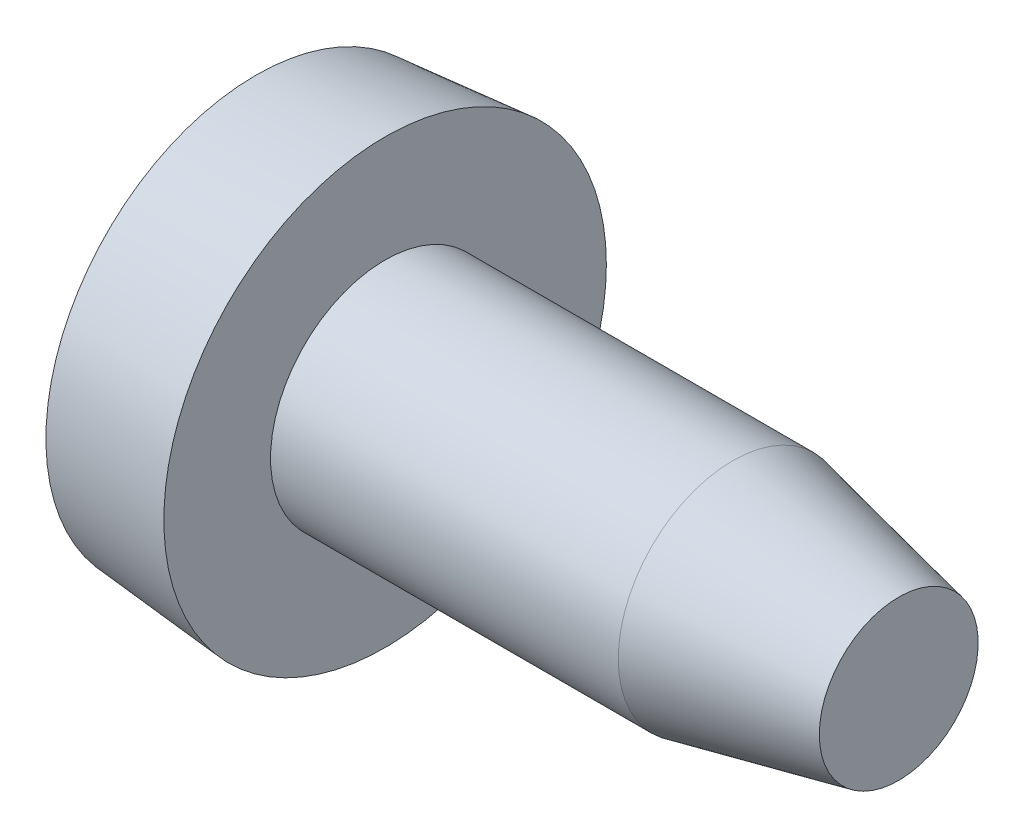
ISO-10303-21;
HEADER;
FILE_DESCRIPTION(('STEP AP214'),'2;1');
FILE_NAME('part.step','',(''),(''),'','','');
FILE_SCHEMA(('AUTOMOTIVE_DESIGN { 1 0 10303 214 1 1 1 1 }'));
ENDSEC;
DATA;
#1=APPLICATION_CONTEXT('core data for automotive mechanical design processes');
#2=APPLICATION_PROTOCOL_DEFINITION('international standard','automotive_design',2000,#1);
#3=PRODUCT_CONTEXT('',#1,'mechanical');
#4=PRODUCT('Part','Part','',(#3));
#5=PRODUCT_RELATED_PRODUCT_CATEGORY('part','',(#4));
#6=PRODUCT_DEFINITION_FORMATION('','',#4);
#7=PRODUCT_DEFINITION_CONTEXT('part definition',#1,'design');
#8=PRODUCT_DEFINITION('design','',#6,#7);
#9=PRODUCT_DEFINITION_SHAPE('','',#8);
#10=(LENGTH_UNIT() NAMED_UNIT(*) SI_UNIT(.MILLI.,.METRE.));
#11=(NAMED_UNIT(*) PLANE_ANGLE_UNIT() SI_UNIT($,.RADIAN.));
#12=(NAMED_UNIT(*) SI_UNIT($,.STERADIAN.) SOLID_ANGLE_UNIT());
#13=UNCERTAINTY_MEASURE_WITH_UNIT(LENGTH_MEASURE(1.E-05),#10,'distance_accuracy_value','');
#14=(GEOMETRIC_REPRESENTATION_CONTEXT(3) GLOBAL_UNCERTAINTY_ASSIGNED_CONTEXT((#13)) GLOBAL_UNIT_ASSIGNED_CONTEXT((#10,
#11,#12)) REPRESENTATION_CONTEXT('',''));
#15=CARTESIAN_POINT('',(0.,0.,0.));
#16=DIRECTION('',(0.,0.,1.));
#17=DIRECTION('',(1.,0.,0.));
#18=AXIS2_PLACEMENT_3D('',#15,#16,#17);
#19=CARTESIAN_POINT('',(-1.70366554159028,0.,-0.255));
#20=DIRECTION('',(0.,0.,1.));
#21=DIRECTION('',(1.,0.,0.));
#22=AXIS2_PLACEMENT_3D('',#19,#20,#21);
#23=PLANE('',#22);
#24=CARTESIAN_POINT('',(-2.38697804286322,-0.254999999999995,-0.255));
#25=CARTESIAN_POINT('',(-2.38080941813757,-0.375863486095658,-0.255000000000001));
#26=CARTESIAN_POINT('',(-2.37022720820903,-0.496488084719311,-0.255));
#27=CARTESIAN_POINT('',(-2.34040446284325,-0.736102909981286,-0.255));
#28=CARTESIAN_POINT('',(-2.321203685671,-0.855098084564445,-0.254999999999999));
#29=CARTESIAN_POINT('',(-2.26269549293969,-1.14959225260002,-0.255));
#30=CARTESIAN_POINT('',(-2.21814295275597,-1.32406276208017,-0.255000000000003));
#31=CARTESIAN_POINT('',(-2.16423628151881,-1.4956696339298,-0.25500000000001));
#32=B_SPLINE_CURVE_WITH_KNOTS('',3,(#24,#25,#26,#27,#28,#29,#30,#31),.UNSPECIFIED.,.F.,.F.,(4,2,
2,4),(0.,0.362956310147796,0.724255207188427,1.26345566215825),.UNSPECIFIED.);
#33=CARTESIAN_POINT('',(-2.38697804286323,-0.254999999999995,-0.255));
#34=VERTEX_POINT('',#33);
#35=CARTESIAN_POINT('',(-2.16423628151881,-1.49566963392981,-0.255000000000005));
#36=VERTEX_POINT('',#35);
#37=EDGE_CURVE('E19',#34,#36,#32,.T.);
#38=ORIENTED_EDGE('',*,*,#37,.T.);
#39=DIRECTION('',(0.78348098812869,0.621415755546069,0.));
#40=VECTOR('',#39,1.);
#41=CARTESIAN_POINT('',(-0.599999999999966,-0.254999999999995,-0.255));
#42=LINE('',#41,#40);
#43=CARTESIAN_POINT('',(-0.599999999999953,-0.254999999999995,-0.254999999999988));
#44=VERTEX_POINT('',#43);
#45=EDGE_CURVE('E79',#36,#44,#42,.T.);
#46=ORIENTED_EDGE('',*,*,#45,.T.);
#47=DIRECTION('',(1.,0.,0.));
#48=VECTOR('',#47,1.);
#49=CARTESIAN_POINT('',(-1.70366554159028,-0.254999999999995,-0.255));
#50=LINE('',#49,#48);
#51=EDGE_CURVE('E221',#44,#34,#50,.F.);
#52=ORIENTED_EDGE('',*,*,#51,.T.);
#53=EDGE_LOOP('',(#38,#46,#52));
#54=FACE_BOUND('',#53,.T.);
#55=ADVANCED_FACE('F15',(#54),#23,.T.);
#56=CARTESIAN_POINT('',(-1.70366554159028,-0.254999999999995,0.));
#57=DIRECTION('',(0.,-1.,0.));
#58=DIRECTION('',(0.,0.,-1.));
#59=AXIS2_PLACEMENT_3D('',#56,#57,#58);
#60=PLANE('',#59);
#61=ORIENTED_EDGE('',*,*,#51,.F.);
#62=DIRECTION('',(-0.78348098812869,0.,-0.621415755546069));
#63=VECTOR('',#62,1.);
#64=CARTESIAN_POINT('',(-0.599999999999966,-0.254999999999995,-0.254999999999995));
#65=LINE('',#64,#63);
#66=CARTESIAN_POINT('',(-2.16423628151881,-0.255,-1.49566963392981));
#67=VERTEX_POINT('',#66);
#68=EDGE_CURVE('E291',#44,#67,#65,.T.);
#69=ORIENTED_EDGE('',*,*,#68,.T.);
#70=CARTESIAN_POINT('',(-2.38697804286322,-0.254999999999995,-0.255));
#71=CARTESIAN_POINT('',(-2.38080941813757,-0.254999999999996,-0.375863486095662));
#72=CARTESIAN_POINT('',(-2.37022720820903,-0.254999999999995,-0.496488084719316));
#73=CARTESIAN_POINT('',(-2.34040446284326,-0.254999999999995,-0.736102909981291));
#74=CARTESIAN_POINT('',(-2.321203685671,-0.254999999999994,-0.85509808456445));
#75=CARTESIAN_POINT('',(-2.2626954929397,-0.254999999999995,-1.14959225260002));
#76=CARTESIAN_POINT('',(-2.21814295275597,-0.254999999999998,-1.32406276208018));
#77=CARTESIAN_POINT('',(-2.16423628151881,-0.255000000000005,-1.4956696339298));
#78=B_SPLINE_CURVE_WITH_KNOTS('',3,(#70,#71,#72,#73,#74,#75,#76,#77),.UNSPECIFIED.,.F.,.F.,(4,2,
2,4),(0.,0.362956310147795,0.724255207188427,1.26345566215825),.UNSPECIFIED.);
#79=EDGE_CURVE('E216',#34,#67,#78,.T.);
#80=ORIENTED_EDGE('',*,*,#79,.F.);
#81=EDGE_LOOP('',(#61,#69,#80));
#82=FACE_BOUND('',#81,.T.);
#83=ADVANCED_FACE('F222',(#82),#60,.F.);
#84=CARTESIAN_POINT('',(-0.599999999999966,-0.254999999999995,0.));
#85=DIRECTION('',(0.621415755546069,-0.78348098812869,0.));
#86=DIRECTION('',(0.78348098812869,0.621415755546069,0.));
#87=AXIS2_PLACEMENT_3D('',#84,#85,#86);
#88=PLANE('',#87);
#89=DIRECTION('',(0.783480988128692,0.621415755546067,0.));
#90=VECTOR('',#89,1.);
#91=CARTESIAN_POINT('',(-2.16423628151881,-1.49566963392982,0.255));
#92=LINE('',#91,#90);
#93=CARTESIAN_POINT('',(-2.16423628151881,-1.49566963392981,0.255000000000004));
#94=VERTEX_POINT('',#93);
#95=CARTESIAN_POINT('',(-0.599999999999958,-0.254999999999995,0.25500000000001));
#96=VERTEX_POINT('',#95);
#97=EDGE_CURVE('E330',#94,#96,#92,.T.);
#98=ORIENTED_EDGE('',*,*,#97,.T.);
#99=DIRECTION('',(0.,0.,1.));
#100=VECTOR('',#99,1.);
#101=CARTESIAN_POINT('',(-0.599999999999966,-0.254999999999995,0.));
#102=LINE('',#101,#100);
#103=EDGE_CURVE('E98',#44,#96,#102,.T.);
#104=ORIENTED_EDGE('',*,*,#103,.F.);
#105=ORIENTED_EDGE('',*,*,#45,.F.);
#106=CARTESIAN_POINT('',(-2.1642362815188,-1.49566963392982,0.255));
#107=CARTESIAN_POINT('',(-2.16787609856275,-1.49855654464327,0.17));
#108=CARTESIAN_POINT('',(-2.16969600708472,-1.5,0.0850000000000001));
#109=CARTESIAN_POINT('',(-2.16969600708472,-1.5,-0.0849999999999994));
#110=CARTESIAN_POINT('',(-2.16787609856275,-1.49855654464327,-0.169999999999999));
#111=CARTESIAN_POINT('',(-2.1642362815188,-1.49566963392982,-0.254999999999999));
#112=B_SPLINE_CURVE_WITH_KNOTS('',3,(#106,#107,#108,#109,#110,#111),.UNSPECIFIED.,.F.,.F.,(4,2,
4),(0.,0.255095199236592,0.510190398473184),.UNSPECIFIED.);
#113=EDGE_CURVE('E211',#94,#36,#112,.T.);
#114=ORIENTED_EDGE('',*,*,#113,.F.);
#115=EDGE_LOOP('',(#98,#104,#105,#114));
#116=FACE_BOUND('',#115,.T.);
#117=ADVANCED_FACE('F225',(#116),#88,.F.);
#118=CARTESIAN_POINT('',(-0.599999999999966,0.,-0.254999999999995));
#119=DIRECTION('',(0.621415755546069,0.,-0.78348098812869));
#120=DIRECTION('',(-0.78348098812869,0.,-0.621415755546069));
#121=AXIS2_PLACEMENT_3D('',#118,#119,#120);
#122=PLANE('',#121);
#123=ORIENTED_EDGE('',*,*,#68,.F.);
#124=DIRECTION('',(0.,1.,0.));
#125=VECTOR('',#124,1.);
#126=CARTESIAN_POINT('',(-0.599999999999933,0.,-0.254999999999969));
#127=LINE('',#126,#125);
#128=CARTESIAN_POINT('',(-0.599999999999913,0.254999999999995,-0.254999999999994));
#129=VERTEX_POINT('',#128);
#130=EDGE_CURVE('E289',#129,#44,#127,.F.);
#131=ORIENTED_EDGE('',*,*,#130,.F.);
#132=DIRECTION('',(0.783480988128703,0.,0.621415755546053));
#133=VECTOR('',#132,1.);
#134=CARTESIAN_POINT('',(-2.16423628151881,0.254999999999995,-1.49566963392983));
#135=LINE('',#134,#133);
#136=CARTESIAN_POINT('',(-2.16423628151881,0.254999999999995,-1.49566963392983));
#137=VERTEX_POINT('',#136);
#138=EDGE_CURVE('E323',#137,#129,#135,.T.);
#139=ORIENTED_EDGE('',*,*,#138,.F.);
#140=CARTESIAN_POINT('',(-2.16423628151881,-0.254999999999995,-1.49566963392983));
#141=CARTESIAN_POINT('',(-2.16787609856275,-0.169999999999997,-1.49855654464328));
#142=CARTESIAN_POINT('',(-2.16969600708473,-0.084999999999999,-1.5));
#143=CARTESIAN_POINT('',(-2.16969600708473,0.084999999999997,-1.5));
#144=CARTESIAN_POINT('',(-2.16787609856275,0.169999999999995,-1.49855654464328));
#145=CARTESIAN_POINT('',(-2.16423628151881,0.254999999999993,-1.49566963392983));
#146=B_SPLINE_CURVE_WITH_KNOTS('',3,(#140,#141,#142,#143,#144,#145),.UNSPECIFIED.,.F.,.F.,(4,2,
4),(0.,0.255095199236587,0.510190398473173),.UNSPECIFIED.);
#147=EDGE_CURVE('E205',#67,#137,#146,.T.);
#148=ORIENTED_EDGE('',*,*,#147,.F.);
#149=EDGE_LOOP('',(#123,#131,#139,#148));
#150=FACE_BOUND('',#149,.T.);
#151=ADVANCED_FACE('F230',(#150),#122,.F.);
#152=CARTESIAN_POINT('',(-1.70366554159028,0.,0.255));
#153=DIRECTION('',(0.,0.,1.));
#154=DIRECTION('',(1.,0.,0.));
#155=AXIS2_PLACEMENT_3D('',#152,#153,#154);
#156=PLANE('',#155);
#157=ORIENTED_EDGE('',*,*,#97,.F.);
#158=CARTESIAN_POINT('',(-2.38697804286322,-0.254999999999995,0.255));
#159=CARTESIAN_POINT('',(-2.38080941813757,-0.375863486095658,0.255));
#160=CARTESIAN_POINT('',(-2.37022720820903,-0.496488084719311,0.255));
#161=CARTESIAN_POINT('',(-2.34040446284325,-0.736102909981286,0.255));
#162=CARTESIAN_POINT('',(-2.321203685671,-0.855098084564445,0.255));
#163=CARTESIAN_POINT('',(-2.26269549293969,-1.14959225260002,0.255000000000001));
#164=CARTESIAN_POINT('',(-2.21814295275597,-1.32406276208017,0.255000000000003));
#165=CARTESIAN_POINT('',(-2.16423628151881,-1.4956696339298,0.255000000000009));
#166=B_SPLINE_CURVE_WITH_KNOTS('',3,(#158,#159,#160,#161,#162,#163,#164,#165),.UNSPECIFIED.,.F.,
.F.,(4,2,2,4),(0.,0.362956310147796,0.724255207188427,1.26345566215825),.UNSPECIFIED.);
#167=CARTESIAN_POINT('',(-2.38697804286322,-0.254999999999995,0.255));
#168=VERTEX_POINT('',#167);
#169=EDGE_CURVE('E198',#168,#94,#166,.T.);
#170=ORIENTED_EDGE('',*,*,#169,.F.);
#171=DIRECTION('',(1.,0.,0.));
#172=VECTOR('',#171,1.);
#173=CARTESIAN_POINT('',(-1.70366554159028,-0.254999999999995,0.255));
#174=LINE('',#173,#172);
#175=EDGE_CURVE('E320',#168,#96,#174,.T.);
#176=ORIENTED_EDGE('',*,*,#175,.T.);
#177=EDGE_LOOP('',(#157,#170,#176));
#178=FACE_BOUND('',#177,.T.);
#179=ADVANCED_FACE('F234',(#178),#156,.F.);
#180=CARTESIAN_POINT('',(-1.70366554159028,0.254999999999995,0.));
#181=DIRECTION('',(0.,-1.,0.));
#182=DIRECTION('',(0.,0.,-1.));
#183=AXIS2_PLACEMENT_3D('',#180,#181,#182);
#184=PLANE('',#183);
#185=ORIENTED_EDGE('',*,*,#138,.T.);
#186=DIRECTION('',(1.,0.,0.));
#187=VECTOR('',#186,1.);
#188=CARTESIAN_POINT('',(-1.70366554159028,0.254999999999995,-0.255));
#189=LINE('',#188,#187);
#190=CARTESIAN_POINT('',(-2.38697804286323,0.254999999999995,-0.255));
#191=VERTEX_POINT('',#190);
#192=EDGE_CURVE('E316',#191,#129,#189,.T.);
#193=ORIENTED_EDGE('',*,*,#192,.F.);
#194=CARTESIAN_POINT('',(-2.38697804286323,0.254999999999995,-0.255));
#195=CARTESIAN_POINT('',(-2.38080941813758,0.254999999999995,-0.375863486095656));
#196=CARTESIAN_POINT('',(-2.37022720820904,0.254999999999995,-0.496488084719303));
#197=CARTESIAN_POINT('',(-2.34040446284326,0.254999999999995,-0.736102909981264));
#198=CARTESIAN_POINT('',(-2.32120368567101,0.254999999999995,-0.855098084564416));
#199=CARTESIAN_POINT('',(-2.2626954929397,0.254999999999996,-1.1495922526));
#200=CARTESIAN_POINT('',(-2.21814295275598,0.254999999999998,-1.32406276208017));
#201=CARTESIAN_POINT('',(-2.16423628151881,0.255000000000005,-1.4956696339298));
#202=B_SPLINE_CURVE_WITH_KNOTS('',3,(#194,#195,#196,#197,#198,#199,#200,#201),.UNSPECIFIED.,.F.,
.F.,(4,2,2,4),(0.,0.362956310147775,0.724255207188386,1.26345566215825),.UNSPECIFIED.);
#203=EDGE_CURVE('E191',#191,#137,#202,.T.);
#204=ORIENTED_EDGE('',*,*,#203,.T.);
#205=EDGE_LOOP('',(#185,#193,#204));
#206=FACE_BOUND('',#205,.T.);
#207=ADVANCED_FACE('F238',(#206),#184,.T.);
#208=CARTESIAN_POINT('',(-1.70366554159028,-0.254999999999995,0.));
#209=DIRECTION('',(0.,-1.,0.));
#210=DIRECTION('',(0.,0.,-1.));
#211=AXIS2_PLACEMENT_3D('',#208,#209,#210);
#212=PLANE('',#211);
#213=DIRECTION('',(0.783480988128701,0.,-0.621415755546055));
#214=VECTOR('',#213,1.);
#215=CARTESIAN_POINT('',(-2.16969600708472,-0.254999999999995,1.5));
#216=LINE('',#215,#214);
#217=CARTESIAN_POINT('',(-2.16423628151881,-0.254999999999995,1.49566963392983));
#218=VERTEX_POINT('',#217);
#219=EDGE_CURVE('E103',#218,#96,#216,.T.);
#220=ORIENTED_EDGE('',*,*,#219,.T.);
#221=ORIENTED_EDGE('',*,*,#175,.F.);
#222=CARTESIAN_POINT('',(-2.16423628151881,-0.254999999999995,1.49566963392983));
#223=CARTESIAN_POINT('',(-2.21469075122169,-0.254999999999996,1.3350971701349));
#224=CARTESIAN_POINT('',(-2.25695855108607,-0.254999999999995,1.17192070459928));
#225=CARTESIAN_POINT('',(-2.32461908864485,-0.254999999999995,0.8431826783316));
#226=CARTESIAN_POINT('',(-2.35011698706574,-0.254999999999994,0.677642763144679));
#227=CARTESIAN_POINT('',(-2.37602868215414,-0.254999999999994,0.426031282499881));
#228=CARTESIAN_POINT('',(-2.38261125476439,-0.254999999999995,0.340564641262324));
#229=CARTESIAN_POINT('',(-2.38697804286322,-0.254999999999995,0.254999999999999));
#230=B_SPLINE_CURVE_WITH_KNOTS('',3,(#222,#223,#224,#225,#226,#227,#228,#229),.UNSPECIFIED.,.F.,
.F.,(4,2,2,4),(0.,0.504788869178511,1.00638133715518,1.26342207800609),.UNSPECIFIED.);
#231=EDGE_CURVE('E184',#218,#168,#230,.T.);
#232=ORIENTED_EDGE('',*,*,#231,.F.);
#233=EDGE_LOOP('',(#220,#221,#232));
#234=FACE_BOUND('',#233,.T.);
#235=ADVANCED_FACE('F242',(#234),#212,.F.);
#236=CARTESIAN_POINT('',(-0.599999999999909,0.254999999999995,0.));
#237=DIRECTION('',(1.,-1.114577E-13,0.));
#238=DIRECTION('',(1.114577E-13,1.,0.));
#239=AXIS2_PLACEMENT_3D('',#236,#237,#238);
#240=PLANE('',#239);
#241=DIRECTION('',(0.,0.,1.));
#242=VECTOR('',#241,1.);
#243=CARTESIAN_POINT('',(-0.599999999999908,0.254999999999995,0.));
#244=LINE('',#243,#242);
#245=CARTESIAN_POINT('',(-0.599999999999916,0.254999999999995,0.255000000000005));
#246=VERTEX_POINT('',#245);
#247=EDGE_CURVE('E95',#246,#129,#244,.F.);
#248=ORIENTED_EDGE('',*,*,#247,.T.);
#249=ORIENTED_EDGE('',*,*,#130,.T.);
#250=ORIENTED_EDGE('',*,*,#103,.T.);
#251=DIRECTION('',(0.,1.,0.));
#252=VECTOR('',#251,1.);
#253=CARTESIAN_POINT('',(-0.599999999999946,0.,0.255000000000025));
#254=LINE('',#253,#252);
#255=EDGE_CURVE('E90',#96,#246,#254,.T.);
#256=ORIENTED_EDGE('',*,*,#255,.T.);
#257=EDGE_LOOP('',(#248,#249,#250,#256));
#258=FACE_BOUND('',#257,.T.);
#259=ADVANCED_FACE('F92',(#258),#240,.F.);
#260=CARTESIAN_POINT('',(-1.70366554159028,0.,-0.255));
#261=DIRECTION('',(0.,0.,1.));
#262=DIRECTION('',(1.,0.,0.));
#263=AXIS2_PLACEMENT_3D('',#260,#261,#262);
#264=PLANE('',#263);
#265=DIRECTION('',(-0.783480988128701,0.621415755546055,0.));
#266=VECTOR('',#265,1.);
#267=CARTESIAN_POINT('',(-2.16969600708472,1.5,-0.255));
#268=LINE('',#267,#266);
#269=CARTESIAN_POINT('',(-2.16423628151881,1.49566963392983,-0.255));
#270=VERTEX_POINT('',#269);
#271=EDGE_CURVE('E121',#129,#270,#268,.T.);
#272=ORIENTED_EDGE('',*,*,#271,.T.);
#273=CARTESIAN_POINT('',(-2.16423628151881,1.49566963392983,-0.255));
#274=CARTESIAN_POINT('',(-2.21469075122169,1.33509717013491,-0.254999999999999));
#275=CARTESIAN_POINT('',(-2.25695855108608,1.17192070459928,-0.255));
#276=CARTESIAN_POINT('',(-2.32461908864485,0.843182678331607,-0.255000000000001));
#277=CARTESIAN_POINT('',(-2.35011698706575,0.677642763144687,-0.255000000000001));
#278=CARTESIAN_POINT('',(-2.37602868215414,0.426031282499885,-0.255000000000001));
#279=CARTESIAN_POINT('',(-2.38261125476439,0.340564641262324,-0.255000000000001));
#280=CARTESIAN_POINT('',(-2.38697804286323,0.254999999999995,-0.255));
#281=B_SPLINE_CURVE_WITH_KNOTS('',3,(#273,#274,#275,#276,#277,#278,#279,#280),.UNSPECIFIED.,.F.,
.F.,(4,2,2,4),(0.,0.504788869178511,1.00638133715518,1.26342207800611),.UNSPECIFIED.);
#282=EDGE_CURVE('E177',#270,#191,#281,.T.);
#283=ORIENTED_EDGE('',*,*,#282,.T.);
#284=ORIENTED_EDGE('',*,*,#192,.T.);
#285=EDGE_LOOP('',(#272,#283,#284));
#286=FACE_BOUND('',#285,.T.);
#287=ADVANCED_FACE('F249',(#286),#264,.T.);
#288=CARTESIAN_POINT('',(-2.16969600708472,0.,1.5));
#289=DIRECTION('',(0.621415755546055,0.,0.783480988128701));
#290=DIRECTION('',(0.783480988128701,0.,-0.621415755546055));
#291=AXIS2_PLACEMENT_3D('',#288,#289,#290);
#292=PLANE('',#291);
#293=DIRECTION('',(-0.783480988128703,0.,0.621415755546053));
#294=VECTOR('',#293,1.);
#295=CARTESIAN_POINT('',(-0.599999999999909,0.254999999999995,0.255));
#296=LINE('',#295,#294);
#297=CARTESIAN_POINT('',(-2.16423628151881,0.254999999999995,1.49566963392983));
#298=VERTEX_POINT('',#297);
#299=EDGE_CURVE('E107',#246,#298,#296,.T.);
#300=ORIENTED_EDGE('',*,*,#299,.F.);
#301=ORIENTED_EDGE('',*,*,#255,.F.);
#302=ORIENTED_EDGE('',*,*,#219,.F.);
#303=CARTESIAN_POINT('',(-2.16423628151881,0.254999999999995,1.49566963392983));
#304=CARTESIAN_POINT('',(-2.16787609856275,0.169999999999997,1.49855654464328));
#305=CARTESIAN_POINT('',(-2.16969600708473,0.0849999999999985,1.5));
#306=CARTESIAN_POINT('',(-2.16969600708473,-0.0849999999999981,1.5));
#307=CARTESIAN_POINT('',(-2.16787609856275,-0.169999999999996,1.49855654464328));
#308=CARTESIAN_POINT('',(-2.16423628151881,-0.254999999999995,1.49566963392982));
#309=B_SPLINE_CURVE_WITH_KNOTS('',3,(#303,#304,#305,#306,#307,#308),.UNSPECIFIED.,.F.,.F.,(4,2,
4),(0.,0.255095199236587,0.510190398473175),.UNSPECIFIED.);
#310=EDGE_CURVE('E102',#298,#218,#309,.T.);
#311=ORIENTED_EDGE('',*,*,#310,.F.);
#312=EDGE_LOOP('',(#300,#301,#302,#311));
#313=FACE_BOUND('',#312,.T.);
#314=ADVANCED_FACE('F108',(#313),#292,.F.);
#315=CARTESIAN_POINT('',(-2.16969600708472,1.5,0.));
#316=DIRECTION('',(0.621415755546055,0.783480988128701,0.));
#317=DIRECTION('',(-0.783480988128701,0.621415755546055,0.));
#318=AXIS2_PLACEMENT_3D('',#315,#316,#317);
#319=PLANE('',#318);
#320=ORIENTED_EDGE('',*,*,#271,.F.);
#321=ORIENTED_EDGE('',*,*,#247,.F.);
#322=DIRECTION('',(-0.783480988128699,0.621415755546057,0.));
#323=VECTOR('',#322,1.);
#324=CARTESIAN_POINT('',(-0.599999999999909,0.254999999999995,0.255));
#325=LINE('',#324,#323);
#326=CARTESIAN_POINT('',(-2.16423628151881,1.49566963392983,0.255));
#327=VERTEX_POINT('',#326);
#328=EDGE_CURVE('E112',#246,#327,#325,.T.);
#329=ORIENTED_EDGE('',*,*,#328,.T.);
#330=CARTESIAN_POINT('',(-2.16423628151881,1.49566963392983,-0.254999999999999));
#331=CARTESIAN_POINT('',(-2.16787609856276,1.49855654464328,-0.17));
#332=CARTESIAN_POINT('',(-2.16969600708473,1.5,-0.0849999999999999));
#333=CARTESIAN_POINT('',(-2.16969600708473,1.5,0.0849999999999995));
#334=CARTESIAN_POINT('',(-2.16787609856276,1.49855654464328,0.169999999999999));
#335=CARTESIAN_POINT('',(-2.16423628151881,1.49566963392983,0.254999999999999));
#336=B_SPLINE_CURVE_WITH_KNOTS('',3,(#330,#331,#332,#333,#334,#335),.UNSPECIFIED.,.F.,.F.,(4,2,
4),(0.,0.255095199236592,0.510190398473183),.UNSPECIFIED.);
#337=EDGE_CURVE('E39',#270,#327,#336,.T.);
#338=ORIENTED_EDGE('',*,*,#337,.F.);
#339=EDGE_LOOP('',(#320,#321,#329,#338));
#340=FACE_BOUND('',#339,.T.);
#341=ADVANCED_FACE('F117',(#340),#319,.F.);
#342=CARTESIAN_POINT('',(-1.70366554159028,0.254999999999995,0.));
#343=DIRECTION('',(0.,-1.,0.));
#344=DIRECTION('',(0.,0.,-1.));
#345=AXIS2_PLACEMENT_3D('',#342,#343,#344);
#346=PLANE('',#345);
#347=DIRECTION('',(1.,0.,0.));
#348=VECTOR('',#347,1.);
#349=CARTESIAN_POINT('',(-1.70366554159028,0.254999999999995,0.255));
#350=LINE('',#349,#348);
#351=CARTESIAN_POINT('',(-2.38697804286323,0.254999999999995,0.255));
#352=VERTEX_POINT('',#351);
#353=EDGE_CURVE('E124',#352,#246,#350,.T.);
#354=ORIENTED_EDGE('',*,*,#353,.T.);
#355=ORIENTED_EDGE('',*,*,#299,.T.);
#356=CARTESIAN_POINT('',(-2.16423628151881,0.254999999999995,1.49566963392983));
#357=CARTESIAN_POINT('',(-2.21469075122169,0.254999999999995,1.33509717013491));
#358=CARTESIAN_POINT('',(-2.25695855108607,0.254999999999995,1.17192070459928));
#359=CARTESIAN_POINT('',(-2.32461908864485,0.254999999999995,0.843182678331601));
#360=CARTESIAN_POINT('',(-2.35011698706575,0.254999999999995,0.67764276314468));
#361=CARTESIAN_POINT('',(-2.37602868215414,0.254999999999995,0.426031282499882));
#362=CARTESIAN_POINT('',(-2.38261125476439,0.254999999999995,0.340564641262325));
#363=CARTESIAN_POINT('',(-2.38697804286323,0.254999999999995,0.255));
#364=B_SPLINE_CURVE_WITH_KNOTS('',3,(#356,#357,#358,#359,#360,#361,#362,#363),.UNSPECIFIED.,.F.,
.F.,(4,2,2,4),(0.,0.504788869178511,1.00638133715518,1.26342207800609),.UNSPECIFIED.);
#365=EDGE_CURVE('E113',#298,#352,#364,.T.);
#366=ORIENTED_EDGE('',*,*,#365,.T.);
#367=EDGE_LOOP('',(#354,#355,#366));
#368=FACE_BOUND('',#367,.T.);
#369=ADVANCED_FACE('F125',(#368),#346,.T.);
#370=CARTESIAN_POINT('',(-1.70366554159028,0.,0.255));
#371=DIRECTION('',(0.,0.,1.));
#372=DIRECTION('',(1.,0.,0.));
#373=AXIS2_PLACEMENT_3D('',#370,#371,#372);
#374=PLANE('',#373);
#375=CARTESIAN_POINT('',(-2.16423628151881,1.49566963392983,0.255));
#376=CARTESIAN_POINT('',(-2.21469075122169,1.33509717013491,0.254999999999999));
#377=CARTESIAN_POINT('',(-2.25695855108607,1.17192070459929,0.255));
#378=CARTESIAN_POINT('',(-2.32461908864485,0.84318267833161,0.255));
#379=CARTESIAN_POINT('',(-2.35011698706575,0.677642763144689,0.255000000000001));
#380=CARTESIAN_POINT('',(-2.37602868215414,0.426031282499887,0.255000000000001));
#381=CARTESIAN_POINT('',(-2.38261125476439,0.340564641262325,0.255000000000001));
#382=CARTESIAN_POINT('',(-2.38697804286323,0.254999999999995,0.255));
#383=B_SPLINE_CURVE_WITH_KNOTS('',3,(#375,#376,#377,#378,#379,#380,#381,#382),.UNSPECIFIED.,.F.,
.F.,(4,2,2,4),(0.,0.504788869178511,1.00638133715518,1.26342207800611),.UNSPECIFIED.);
#384=EDGE_CURVE('E127',#327,#352,#383,.T.);
#385=ORIENTED_EDGE('',*,*,#384,.F.);
#386=ORIENTED_EDGE('',*,*,#328,.F.);
#387=ORIENTED_EDGE('',*,*,#353,.F.);
#388=EDGE_LOOP('',(#385,#386,#387));
#389=FACE_BOUND('',#388,.T.);
#390=ADVANCED_FACE('F129',(#389),#374,.F.);
#391=CARTESIAN_POINT('',(2.60000000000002,0.,0.));
#392=DIRECTION('',(1.,0.,0.));
#393=DIRECTION('',(0.,1.,0.));
#394=AXIS2_PLACEMENT_3D('',#391,#392,#393);
#395=SPHERICAL_SURFACE('',#394,5.00000000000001);
#396=CARTESIAN_POINT('',(-1.63566947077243,0.,0.));
#397=DIRECTION('',(1.,0.,0.));
#398=DIRECTION('',(0.,1.,0.));
#399=AXIS2_PLACEMENT_3D('',#396,#397,#398);
#400=CIRCLE('',#399,2.65689746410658);
#401=CARTESIAN_POINT('',(-1.63566947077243,2.65689746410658,0.));
#402=VERTEX_POINT('',#401);
#403=EDGE_CURVE('E138',#402,#402,#400,.T.);
#404=ORIENTED_EDGE('',*,*,#403,.F.);
#405=EDGE_LOOP('',(#404));
#406=FACE_BOUND('',#405,.T.);
#407=ORIENTED_EDGE('',*,*,#337,.T.);
#408=ORIENTED_EDGE('',*,*,#384,.T.);
#409=ORIENTED_EDGE('',*,*,#365,.F.);
#410=ORIENTED_EDGE('',*,*,#310,.T.);
#411=ORIENTED_EDGE('',*,*,#231,.T.);
#412=ORIENTED_EDGE('',*,*,#169,.T.);
#413=ORIENTED_EDGE('',*,*,#113,.T.);
#414=ORIENTED_EDGE('',*,*,#37,.F.);
#415=ORIENTED_EDGE('',*,*,#79,.T.);
#416=ORIENTED_EDGE('',*,*,#147,.T.);
#417=ORIENTED_EDGE('',*,*,#203,.F.);
#418=ORIENTED_EDGE('',*,*,#282,.F.);
#419=EDGE_LOOP('',(#407,#408,#409,#410,#411,#412,#413,#414,#415,#416,#417,#418));
#420=FACE_BOUND('',#419,.T.);
#421=ADVANCED_FACE('F140',(#406,#420),#395,.T.);
#422=CARTESIAN_POINT('',(6.5,0.502499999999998,0.));
#423=DIRECTION('',(1.,0.,0.));
#424=DIRECTION('',(0.,0.,-1.));
#425=AXIS2_PLACEMENT_3D('',#422,#423,#424);
#426=PLANE('',#425);
#427=CARTESIAN_POINT('',(6.50000000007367,0.,0.));
#428=DIRECTION('',(-1.,0.,0.));
#429=DIRECTION('',(0.,0.,1.));
#430=AXIS2_PLACEMENT_3D('',#427,#428,#429);
#431=CIRCLE('',#430,1.00500000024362);
#432=CARTESIAN_POINT('',(6.50000000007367,0.,1.00500000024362));
#433=VERTEX_POINT('',#432);
#434=EDGE_CURVE('E279',#433,#433,#431,.T.);
#435=ORIENTED_EDGE('',*,*,#434,.F.);
#436=EDGE_LOOP('',(#435));
#437=FACE_BOUND('',#436,.T.);
#438=ADVANCED_FACE('F145',(#437),#426,.T.);
#439=CARTESIAN_POINT('',(-1.13686837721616E-10,0.,0.));
#440=DIRECTION('',(1.,0.,0.));
#441=DIRECTION('',(0.,0.,-1.));
#442=AXIS2_PLACEMENT_3D('',#439,#440,#441);
#443=CONICAL_SURFACE('',#442,2.7999999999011,0.0872664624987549);
#444=ORIENTED_EDGE('',*,*,#403,.T.);
#445=EDGE_LOOP('',(#444));
#446=FACE_BOUND('',#445,.T.);
#447=CARTESIAN_POINT('',(0.,0.,0.));
#448=DIRECTION('',(1.,0.,0.));
#449=DIRECTION('',(0.,0.,-1.));
#450=AXIS2_PLACEMENT_3D('',#447,#448,#449);
#451=CIRCLE('',#450,2.79999999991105);
#452=CARTESIAN_POINT('',(0.,0.,-2.79999999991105));
#453=VERTEX_POINT('',#452);
#454=EDGE_CURVE('E276',#453,#453,#451,.T.);
#455=ORIENTED_EDGE('',*,*,#454,.F.);
#456=EDGE_LOOP('',(#455));
#457=FACE_BOUND('',#456,.T.);
#458=ADVANCED_FACE('F415',(#446,#457),#443,.T.);
#459=CARTESIAN_POINT('',(4.39999999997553,0.,0.));
#460=DIRECTION('',(-1.,0.,0.));
#461=DIRECTION('',(0.,0.,1.));
#462=AXIS2_PLACEMENT_3D('',#459,#460,#461);
#463=CONICAL_SURFACE('',#462,1.44999999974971,0.208815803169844);
#464=CARTESIAN_POINT('',(4.39999999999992,0.,0.));
#465=DIRECTION('',(1.,0.,0.));
#466=DIRECTION('',(0.,0.,-1.));
#467=AXIS2_PLACEMENT_3D('',#464,#465,#466);
#468=CIRCLE('',#467,1.45000000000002);
#469=CARTESIAN_POINT('',(4.39999999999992,0.,-1.45000000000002));
#470=VERTEX_POINT('',#469);
#471=EDGE_CURVE('E30',#470,#470,#468,.F.);
#472=ORIENTED_EDGE('',*,*,#471,.F.);
#473=EDGE_LOOP('',(#472));
#474=FACE_BOUND('',#473,.T.);
#475=ORIENTED_EDGE('',*,*,#434,.T.);
#476=EDGE_LOOP('',(#475));
#477=FACE_BOUND('',#476,.T.);
#478=ADVANCED_FACE('F269',(#474,#477),#463,.T.);
#479=CARTESIAN_POINT('',(0.,2.12500000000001,0.));
#480=DIRECTION('',(1.,0.,0.));
#481=DIRECTION('',(0.,0.,-1.));
#482=AXIS2_PLACEMENT_3D('',#479,#480,#481);
#483=PLANE('',#482);
#484=CARTESIAN_POINT('',(0.,0.,0.));
#485=DIRECTION('',(1.,0.,0.));
#486=DIRECTION('',(0.,0.,-1.));
#487=AXIS2_PLACEMENT_3D('',#484,#485,#486);
#488=CIRCLE('',#487,1.45000000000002);
#489=CARTESIAN_POINT('',(0.,0.,-1.45000000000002));
#490=VERTEX_POINT('',#489);
#491=EDGE_CURVE('E10',#490,#490,#488,.T.);
#492=ORIENTED_EDGE('',*,*,#491,.F.);
#493=EDGE_LOOP('',(#492));
#494=FACE_BOUND('',#493,.T.);
#495=ORIENTED_EDGE('',*,*,#454,.T.);
#496=EDGE_LOOP('',(#495));
#497=FACE_BOUND('',#496,.T.);
#498=ADVANCED_FACE('F264',(#494,#497),#483,.T.);
#499=CARTESIAN_POINT('',(2.19999999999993,0.,0.));
#500=DIRECTION('',(1.,0.,0.));
#501=DIRECTION('',(0.,0.,-1.));
#502=AXIS2_PLACEMENT_3D('',#499,#500,#501);
#503=CYLINDRICAL_SURFACE('',#502,1.45000000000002);
#504=ORIENTED_EDGE('',*,*,#491,.T.);
#505=EDGE_LOOP('',(#504));
#506=FACE_BOUND('',#505,.T.);
#507=ORIENTED_EDGE('',*,*,#471,.T.);
#508=EDGE_LOOP('',(#507));
#509=FACE_BOUND('',#508,.T.);
#510=ADVANCED_FACE('F17',(#506,#509),#503,.T.);
#511=CLOSED_SHELL('',(#55,#83,#117,#151,#179,#207,#235,#259,#287,#314,#341,#369,#390,#421,#438,
#458,#478,#498,#510));
#512=MANIFOLD_SOLID_BREP('B1',#511);
#513=ADVANCED_BREP_SHAPE_REPRESENTATION('',(#18,#512),#14);
#514=SHAPE_DEFINITION_REPRESENTATION(#9,#513);
ENDSEC;
END-ISO-10303-21;
